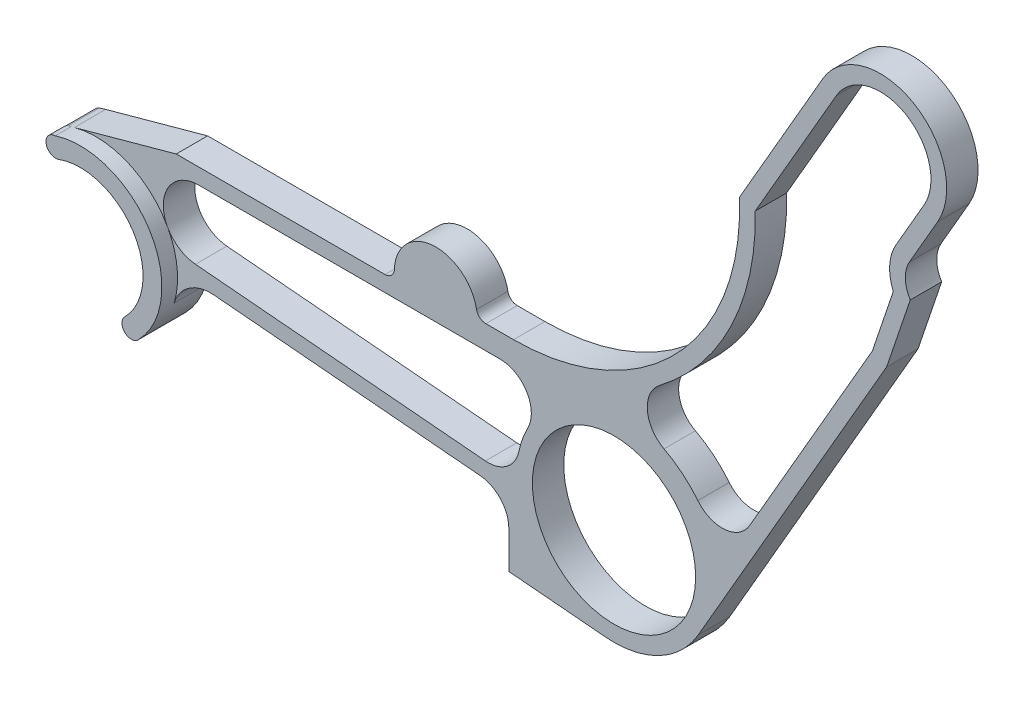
from build123d import *

# Parameters (mm, degrees)
ESQUISSE1_R             = 26
BOSS_EXTRU_1_DEPTH      = 10
ENL_V_MAT_EXTRU_1_DEPTH = 224.928766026
ENL_V_MAT_EXTRU_2_DEPTH = 224.928766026
BOSS_EXTRU_2_DEPTH      = 5


with BuildPart() as part:
    # Esquisse1 → Boss.-Extru.1 (new body)
    # profile 1 of 2: a face of its own
    with BuildSketch(Plane.XY):
        with BuildLine():
            ThreePointArc((-73.66771249, -52.384776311), (-70.152991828, -19.985292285), (-101.045096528, -9.604651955))
            ThreePointArc((-101.045096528, -9.604651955), (-102.822335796, -13.45710839), (-98.96987936, -15.234347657))
            ThreePointArc((-98.96987936, -15.234347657), (-75.206721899, -23.219455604), (-77.910353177, -48.142135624))
            ThreePointArc((-77.910353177, -48.142135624), (-77.910353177, -52.384776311), (-73.66771249, -52.384776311))
        make_face()
    # profile 2 of 2: a face of its own
    with BuildSketch(Plane.XY):
        with BuildLine():
            ThreePointArc((2.998571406, 2.907428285), (2.088334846, 0.846199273), (0, 0))
            Line((0, 0), (-66.48367085, 0))
            Line((-66.48367085, 0), (-98.948973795, -8.931324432))
            ThreePointArc((-98.948973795, -8.931324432), (-73.461487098, -15.823788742), (-67.145779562, -41.460283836))
            ThreePointArc((-67.145779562, -41.460283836), (-62.35411291, -34.926677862), (-54.512731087, -32.886872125))
            Line((-54.512731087, -32.886872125), (30.319068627, -40.308692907))
            ThreePointArc((30.319068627, -40.308692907), (36.820284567, -43.514737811), (39.447511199, -50.270639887))
            Line((39.447511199, -50.270639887), (39.447511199, -62.187544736))
            Line((39.447511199, -62.187544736), (70.245683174, -64.882035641))
            ThreePointArc((70.245683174, -64.882035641), (87.26171821, -61.497335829), (99.794298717, -49.5))
            Line((99.794298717, -49.5), (159.794298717, 54.423048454))
            Line((159.794298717, 54.423048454), (167.308875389, 76.642617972))
            ThreePointArc((167.308875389, 76.642617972), (165.735956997, 81.803463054), (167.073128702, 87.030351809))
            Line((167.073128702, 87.030351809), (176.064008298, 102.603012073))
            ThreePointArc((176.064008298, 102.603012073), (168.326031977, 131.481532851), (139.447511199, 123.74355653))
            Line((139.447511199, 123.74355653), (112.875495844, 77.719475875))
            ThreePointArc((112.875495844, 77.719475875), (92.985008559, 24.739585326), (40.947511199, 2.5))
            Line((40.947511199, 2.5), (32.119454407, 2.5))
            ThreePointArc((32.119454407, 2.5), (30.204551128, 3.190639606), (29.171319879, 4.944569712))
            ThreePointArc((29.171319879, 4.944569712), (15.171337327, 15.66383925), (2.998571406, 2.907428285))
        make_face()
        with Locations((72.947511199, -34)):
            Circle(ESQUISSE1_R, mode=Mode.SUBTRACT)
    extrude(amount=BOSS_EXTRU_1_DEPTH)

    # Esquisse2 → Enl_v. mat.-Extru.1 (cut, through all)
    with BuildSketch(Plane.XY.offset(10)):
        with BuildLine():
            Line((116.10301918, -11.252467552), (155.216518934, 56.494101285))
            Line((155.216518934, 56.494101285), (161.895197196, 76.24203419))
            ThreePointArc((161.895197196, 76.24203419), (160.76381886, 82.98542105), (162.743001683, 89.530351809))
            Line((162.743001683, 89.530351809), (171.733881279, 105.103012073))
            ThreePointArc((171.733881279, 105.103012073), (165.826031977, 127.151405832), (143.777638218, 121.24355653))
            Line((143.777638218, 121.24355653), (117.922531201, 76.46119754))
            ThreePointArc((117.922531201, 76.46119754), (110.34464559, 41.137779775), (87.490164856, 13.158485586))
            ThreePointArc((87.490164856, 13.158485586), (83.568843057, 4.365988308), (88.884321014, -3.6608708))
            ThreePointArc((88.884321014, -3.6608708), (94.722868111, -7.537224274), (99.650779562, -12.520239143))
            ThreePointArc((99.650779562, -12.520239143), (108.211064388, -16.222909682), (116.10301918, -11.252467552))
        make_face()
    extrude(amount=-ENL_V_MAT_EXTRU_1_DEPTH, mode=Mode.SUBTRACT)

    # Esquisse3 → Enl_v. mat.-Extru.2 (cut, through all)
    with BuildSketch(Plane.XY.offset(10)):
        with BuildLine():
            Line((-59.388881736, -5), (36.61570695, -5))
            ThreePointArc((36.61570695, -5), (45.169696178, -9.820302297), (45.477122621, -19.634146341))
            ThreePointArc((45.477122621, -19.634146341), (43.781343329, -23.495969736), (42.625467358, -27.552236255))
            ThreePointArc((42.625467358, -27.552236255), (38.7920592, -33.511126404), (31.972605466, -35.434259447))
            Line((31.972605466, -35.434259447), (-60.364955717, -27.355769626))
            ThreePointArc((-60.364955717, -27.355769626), (-70.577415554, -15.710691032), (-59.388881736, -5))
        make_face()
    extrude(amount=-ENL_V_MAT_EXTRU_2_DEPTH, mode=Mode.SUBTRACT)

    # Esquisse4 → Boss.-Extru.2 (add)
    with BuildSketch(Plane.XY.offset(10)):
        with BuildLine():
            ThreePointArc((-98.96987936, -15.234347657), (-75.206721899, -23.219455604), (-77.910353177, -48.142135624))
            ThreePointArc((-77.910353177, -48.142135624), (-77.910353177, -52.384776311), (-73.66771249, -52.384776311))
            ThreePointArc((-73.66771249, -52.384776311), (-69.861152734, -20.452136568), (-100.004165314, -9.245791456))
            ThreePointArc((-100.004165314, -9.245791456), (-102.919517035, -12.832897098), (-98.96987936, -15.234347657))
        make_face()
    extrude(amount=BOSS_EXTRU_2_DEPTH)


solid = part.part
